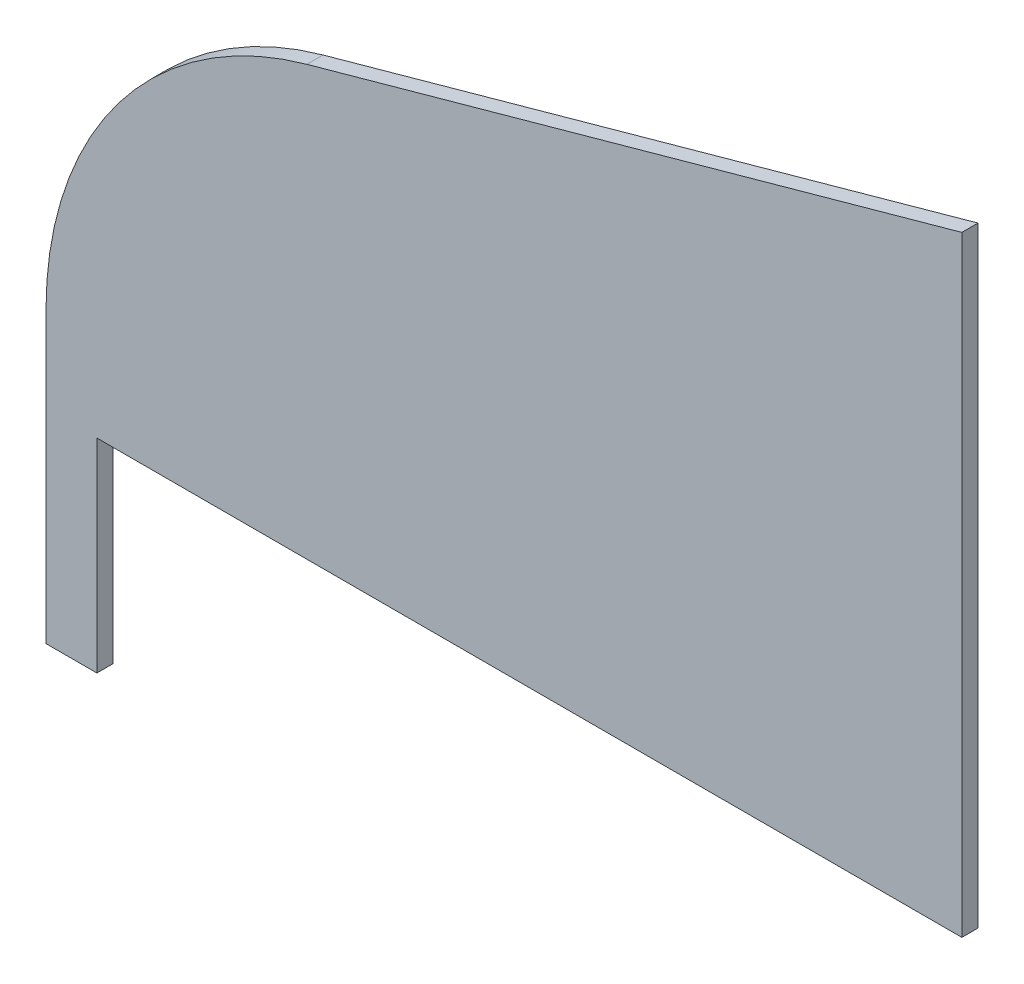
ISO-10303-21;
HEADER;
FILE_DESCRIPTION(('STEP AP214'),'2;1');
FILE_NAME('part.step','',(''),(''),'','','');
FILE_SCHEMA(('AUTOMOTIVE_DESIGN { 1 0 10303 214 1 1 1 1 }'));
ENDSEC;
DATA;
#1=APPLICATION_CONTEXT('core data for automotive mechanical design processes');
#2=APPLICATION_PROTOCOL_DEFINITION('international standard','automotive_design',2000,#1);
#3=PRODUCT_CONTEXT('',#1,'mechanical');
#4=PRODUCT('Part','Part','',(#3));
#5=PRODUCT_RELATED_PRODUCT_CATEGORY('part','',(#4));
#6=PRODUCT_DEFINITION_FORMATION('','',#4);
#7=PRODUCT_DEFINITION_CONTEXT('part definition',#1,'design');
#8=PRODUCT_DEFINITION('design','',#6,#7);
#9=PRODUCT_DEFINITION_SHAPE('','',#8);
#10=(LENGTH_UNIT() NAMED_UNIT(*) SI_UNIT(.MILLI.,.METRE.));
#11=(NAMED_UNIT(*) PLANE_ANGLE_UNIT() SI_UNIT($,.RADIAN.));
#12=(NAMED_UNIT(*) SI_UNIT($,.STERADIAN.) SOLID_ANGLE_UNIT());
#13=UNCERTAINTY_MEASURE_WITH_UNIT(LENGTH_MEASURE(1.E-05),#10,'distance_accuracy_value','');
#14=(GEOMETRIC_REPRESENTATION_CONTEXT(3) GLOBAL_UNCERTAINTY_ASSIGNED_CONTEXT((#13)) GLOBAL_UNIT_ASSIGNED_CONTEXT((#10,
#11,#12)) REPRESENTATION_CONTEXT('',''));
#15=CARTESIAN_POINT('',(0.,0.,0.));
#16=DIRECTION('',(0.,0.,1.));
#17=DIRECTION('',(1.,0.,0.));
#18=AXIS2_PLACEMENT_3D('',#15,#16,#17);
#19=CARTESIAN_POINT('',(0.,0.,3.175));
#20=DIRECTION('',(-1.,0.,0.));
#21=DIRECTION('',(0.,-1.,0.));
#22=AXIS2_PLACEMENT_3D('',#19,#20,#21);
#23=PLANE('',#22);
#24=DIRECTION('',(0.,1.,0.));
#25=VECTOR('',#24,1.);
#26=CARTESIAN_POINT('',(0.,0.,0.));
#27=LINE('',#26,#25);
#28=CARTESIAN_POINT('',(0.,-50.,0.));
#29=VERTEX_POINT('',#28);
#30=CARTESIAN_POINT('',(0.,70.,0.));
#31=VERTEX_POINT('',#30);
#32=EDGE_CURVE('E82',#29,#31,#27,.T.);
#33=ORIENTED_EDGE('',*,*,#32,.T.);
#34=DIRECTION('',(0.,0.,-1.));
#35=VECTOR('',#34,1.);
#36=CARTESIAN_POINT('',(0.,70.,3.175));
#37=LINE('',#36,#35);
#38=CARTESIAN_POINT('',(0.,70.,3.175));
#39=VERTEX_POINT('',#38);
#40=EDGE_CURVE('E11',#39,#31,#37,.T.);
#41=ORIENTED_EDGE('',*,*,#40,.F.);
#42=DIRECTION('',(0.,1.,0.));
#43=VECTOR('',#42,1.);
#44=CARTESIAN_POINT('',(0.,0.,3.175));
#45=LINE('',#44,#43);
#46=CARTESIAN_POINT('',(0.,-50.,3.175));
#47=VERTEX_POINT('',#46);
#48=EDGE_CURVE('E88',#47,#39,#45,.T.);
#49=ORIENTED_EDGE('',*,*,#48,.F.);
#50=DIRECTION('',(0.,0.,-1.));
#51=VECTOR('',#50,1.);
#52=CARTESIAN_POINT('',(0.,-50.,3.175));
#53=LINE('',#52,#51);
#54=EDGE_CURVE('E119',#47,#29,#53,.T.);
#55=ORIENTED_EDGE('',*,*,#54,.T.);
#56=EDGE_LOOP('',(#33,#41,#49,#55));
#57=FACE_BOUND('',#56,.T.);
#58=ADVANCED_FACE('F33',(#57),#23,.F.);
#59=CARTESIAN_POINT('',(0.,70.,3.175));
#60=DIRECTION('',(0.267643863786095,-0.963517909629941,0.));
#61=DIRECTION('',(0.963517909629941,0.267643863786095,0.));
#62=AXIS2_PLACEMENT_3D('',#59,#60,#61);
#63=PLANE('',#62);
#64=DIRECTION('',(-0.963517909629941,-0.267643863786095,0.));
#65=VECTOR('',#64,1.);
#66=CARTESIAN_POINT('',(0.,70.,0.));
#67=LINE('',#66,#65);
#68=CARTESIAN_POINT('',(-128.735070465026,34.2402582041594,0.));
#69=VERTEX_POINT('',#68);
#70=EDGE_CURVE('E124',#31,#69,#67,.T.);
#71=ORIENTED_EDGE('',*,*,#70,.T.);
#72=DIRECTION('',(0.,0.,-1.));
#73=VECTOR('',#72,1.);
#74=CARTESIAN_POINT('',(-128.735070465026,34.2402582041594,3.175));
#75=LINE('',#74,#73);
#76=CARTESIAN_POINT('',(-128.735070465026,34.2402582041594,3.175));
#77=VERTEX_POINT('',#76);
#78=EDGE_CURVE('E41',#77,#69,#75,.T.);
#79=ORIENTED_EDGE('',*,*,#78,.F.);
#80=DIRECTION('',(-0.963517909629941,-0.267643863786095,0.));
#81=VECTOR('',#80,1.);
#82=CARTESIAN_POINT('',(0.,70.,3.175));
#83=LINE('',#82,#81);
#84=EDGE_CURVE('E154',#39,#77,#83,.T.);
#85=ORIENTED_EDGE('',*,*,#84,.F.);
#86=ORIENTED_EDGE('',*,*,#40,.T.);
#87=EDGE_LOOP('',(#71,#79,#85,#86));
#88=FACE_BOUND('',#87,.T.);
#89=ADVANCED_FACE('F158',(#88),#63,.F.);
#90=CARTESIAN_POINT('',(-110.,-33.2059954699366,3.175));
#91=DIRECTION('',(0.,0.,-1.));
#92=DIRECTION('',(-1.,0.,0.));
#93=AXIS2_PLACEMENT_3D('',#90,#91,#92);
#94=CYLINDRICAL_SURFACE('',#93,70.);
#95=CARTESIAN_POINT('',(-110.,-33.2059954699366,0.));
#96=DIRECTION('',(0.,0.,1.));
#97=DIRECTION('',(1.,0.,0.));
#98=AXIS2_PLACEMENT_3D('',#95,#96,#97);
#99=CIRCLE('',#98,70.);
#100=CARTESIAN_POINT('',(-180.,-33.205995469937,0.));
#101=VERTEX_POINT('',#100);
#102=EDGE_CURVE('E126',#69,#101,#99,.T.);
#103=ORIENTED_EDGE('',*,*,#102,.T.);
#104=DIRECTION('',(0.,0.,-1.));
#105=VECTOR('',#104,1.);
#106=CARTESIAN_POINT('',(-180.,-33.205995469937,3.175));
#107=LINE('',#106,#105);
#108=CARTESIAN_POINT('',(-180.,-33.205995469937,3.175));
#109=VERTEX_POINT('',#108);
#110=EDGE_CURVE('E138',#109,#101,#107,.T.);
#111=ORIENTED_EDGE('',*,*,#110,.F.);
#112=CARTESIAN_POINT('',(-110.,-33.2059954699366,3.175));
#113=DIRECTION('',(0.,0.,1.));
#114=DIRECTION('',(1.,0.,0.));
#115=AXIS2_PLACEMENT_3D('',#112,#113,#114);
#116=CIRCLE('',#115,70.);
#117=EDGE_CURVE('E147',#77,#109,#116,.T.);
#118=ORIENTED_EDGE('',*,*,#117,.F.);
#119=ORIENTED_EDGE('',*,*,#78,.T.);
#120=EDGE_LOOP('',(#103,#111,#118,#119));
#121=FACE_BOUND('',#120,.T.);
#122=ADVANCED_FACE('F145',(#121),#94,.T.);
#123=CARTESIAN_POINT('',(-180.,-33.205995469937,3.175));
#124=DIRECTION('',(1.,0.,0.));
#125=DIRECTION('',(0.,0.,-1.));
#126=AXIS2_PLACEMENT_3D('',#123,#124,#125);
#127=PLANE('',#126);
#128=DIRECTION('',(0.,-1.,0.));
#129=VECTOR('',#128,1.);
#130=CARTESIAN_POINT('',(-180.,-33.205995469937,0.));
#131=LINE('',#130,#129);
#132=CARTESIAN_POINT('',(-180.,-90.,0.));
#133=VERTEX_POINT('',#132);
#134=EDGE_CURVE('E128',#101,#133,#131,.T.);
#135=ORIENTED_EDGE('',*,*,#134,.T.);
#136=DIRECTION('',(0.,0.,-1.));
#137=VECTOR('',#136,1.);
#138=CARTESIAN_POINT('',(-180.,-90.,3.175));
#139=LINE('',#138,#137);
#140=CARTESIAN_POINT('',(-180.,-90.,3.175));
#141=VERTEX_POINT('',#140);
#142=EDGE_CURVE('E114',#141,#133,#139,.T.);
#143=ORIENTED_EDGE('',*,*,#142,.F.);
#144=DIRECTION('',(0.,-1.,0.));
#145=VECTOR('',#144,1.);
#146=CARTESIAN_POINT('',(-180.,-33.205995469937,3.175));
#147=LINE('',#146,#145);
#148=EDGE_CURVE('E105',#109,#141,#147,.T.);
#149=ORIENTED_EDGE('',*,*,#148,.F.);
#150=ORIENTED_EDGE('',*,*,#110,.T.);
#151=EDGE_LOOP('',(#135,#143,#149,#150));
#152=FACE_BOUND('',#151,.T.);
#153=ADVANCED_FACE('F153',(#152),#127,.F.);
#154=CARTESIAN_POINT('',(-170.,-90.,3.175));
#155=DIRECTION('',(0.,1.,0.));
#156=DIRECTION('',(0.,0.,1.));
#157=AXIS2_PLACEMENT_3D('',#154,#155,#156);
#158=PLANE('',#157);
#159=DIRECTION('',(1.,0.,0.));
#160=VECTOR('',#159,1.);
#161=CARTESIAN_POINT('',(-170.,-90.,0.));
#162=LINE('',#161,#160);
#163=CARTESIAN_POINT('',(-170.,-90.,0.));
#164=VERTEX_POINT('',#163);
#165=EDGE_CURVE('E113',#133,#164,#162,.T.);
#166=ORIENTED_EDGE('',*,*,#165,.T.);
#167=DIRECTION('',(0.,0.,-1.));
#168=VECTOR('',#167,1.);
#169=CARTESIAN_POINT('',(-170.,-90.,3.175));
#170=LINE('',#169,#168);
#171=CARTESIAN_POINT('',(-170.,-90.,3.175));
#172=VERTEX_POINT('',#171);
#173=EDGE_CURVE('E110',#172,#164,#170,.T.);
#174=ORIENTED_EDGE('',*,*,#173,.F.);
#175=DIRECTION('',(1.,0.,0.));
#176=VECTOR('',#175,1.);
#177=CARTESIAN_POINT('',(-170.,-90.,3.175));
#178=LINE('',#177,#176);
#179=EDGE_CURVE('E99',#141,#172,#178,.T.);
#180=ORIENTED_EDGE('',*,*,#179,.F.);
#181=ORIENTED_EDGE('',*,*,#142,.T.);
#182=EDGE_LOOP('',(#166,#174,#180,#181));
#183=FACE_BOUND('',#182,.T.);
#184=ADVANCED_FACE('F111',(#183),#158,.F.);
#185=CARTESIAN_POINT('',(-170.,-90.,3.175));
#186=DIRECTION('',(-1.,0.,0.));
#187=DIRECTION('',(0.,-1.,0.));
#188=AXIS2_PLACEMENT_3D('',#185,#186,#187);
#189=PLANE('',#188);
#190=DIRECTION('',(0.,1.,0.));
#191=VECTOR('',#190,1.);
#192=CARTESIAN_POINT('',(-170.,-90.,0.));
#193=LINE('',#192,#191);
#194=CARTESIAN_POINT('',(-170.,-50.,0.));
#195=VERTEX_POINT('',#194);
#196=EDGE_CURVE('E75',#164,#195,#193,.T.);
#197=ORIENTED_EDGE('',*,*,#196,.T.);
#198=DIRECTION('',(0.,0.,-1.));
#199=VECTOR('',#198,1.);
#200=CARTESIAN_POINT('',(-170.,-50.,3.175));
#201=LINE('',#200,#199);
#202=CARTESIAN_POINT('',(-170.,-50.,3.175));
#203=VERTEX_POINT('',#202);
#204=EDGE_CURVE('E115',#203,#195,#201,.T.);
#205=ORIENTED_EDGE('',*,*,#204,.F.);
#206=DIRECTION('',(0.,1.,0.));
#207=VECTOR('',#206,1.);
#208=CARTESIAN_POINT('',(-170.,-90.,3.175));
#209=LINE('',#208,#207);
#210=EDGE_CURVE('E103',#172,#203,#209,.T.);
#211=ORIENTED_EDGE('',*,*,#210,.F.);
#212=ORIENTED_EDGE('',*,*,#173,.T.);
#213=EDGE_LOOP('',(#197,#205,#211,#212));
#214=FACE_BOUND('',#213,.T.);
#215=ADVANCED_FACE('F117',(#214),#189,.F.);
#216=CARTESIAN_POINT('',(-170.,-50.,3.175));
#217=DIRECTION('',(0.,1.,0.));
#218=DIRECTION('',(0.,0.,1.));
#219=AXIS2_PLACEMENT_3D('',#216,#217,#218);
#220=PLANE('',#219);
#221=DIRECTION('',(1.,0.,0.));
#222=VECTOR('',#221,1.);
#223=CARTESIAN_POINT('',(-170.,-50.,0.));
#224=LINE('',#223,#222);
#225=EDGE_CURVE('E132',#195,#29,#224,.T.);
#226=ORIENTED_EDGE('',*,*,#225,.T.);
#227=ORIENTED_EDGE('',*,*,#54,.F.);
#228=DIRECTION('',(1.,0.,0.));
#229=VECTOR('',#228,1.);
#230=CARTESIAN_POINT('',(-170.,-50.,3.175));
#231=LINE('',#230,#229);
#232=EDGE_CURVE('E49',#203,#47,#231,.T.);
#233=ORIENTED_EDGE('',*,*,#232,.F.);
#234=ORIENTED_EDGE('',*,*,#204,.T.);
#235=EDGE_LOOP('',(#226,#227,#233,#234));
#236=FACE_BOUND('',#235,.T.);
#237=ADVANCED_FACE('F161',(#236),#220,.F.);
#238=CARTESIAN_POINT('',(-110.,-33.2059954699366,3.175));
#239=DIRECTION('',(0.,0.,1.));
#240=DIRECTION('',(1.,0.,0.));
#241=AXIS2_PLACEMENT_3D('',#238,#239,#240);
#242=PLANE('',#241);
#243=ORIENTED_EDGE('',*,*,#48,.T.);
#244=ORIENTED_EDGE('',*,*,#84,.T.);
#245=ORIENTED_EDGE('',*,*,#117,.T.);
#246=ORIENTED_EDGE('',*,*,#148,.T.);
#247=ORIENTED_EDGE('',*,*,#179,.T.);
#248=ORIENTED_EDGE('',*,*,#210,.T.);
#249=ORIENTED_EDGE('',*,*,#232,.T.);
#250=EDGE_LOOP('',(#243,#244,#245,#246,#247,#248,#249));
#251=FACE_BOUND('',#250,.T.);
#252=ADVANCED_FACE('F101',(#251),#242,.T.);
#253=CARTESIAN_POINT('',(-110.,-33.2059954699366,0.));
#254=DIRECTION('',(0.,0.,1.));
#255=DIRECTION('',(1.,0.,0.));
#256=AXIS2_PLACEMENT_3D('',#253,#254,#255);
#257=PLANE('',#256);
#258=ORIENTED_EDGE('',*,*,#32,.F.);
#259=ORIENTED_EDGE('',*,*,#225,.F.);
#260=ORIENTED_EDGE('',*,*,#196,.F.);
#261=ORIENTED_EDGE('',*,*,#165,.F.);
#262=ORIENTED_EDGE('',*,*,#134,.F.);
#263=ORIENTED_EDGE('',*,*,#102,.F.);
#264=ORIENTED_EDGE('',*,*,#70,.F.);
#265=EDGE_LOOP('',(#258,#259,#260,#261,#262,#263,#264));
#266=FACE_BOUND('',#265,.T.);
#267=ADVANCED_FACE('F151',(#266),#257,.F.);
#268=CLOSED_SHELL('',(#58,#89,#122,#153,#184,#215,#237,#252,#267));
#269=MANIFOLD_SOLID_BREP('B2',#268);
#270=ADVANCED_BREP_SHAPE_REPRESENTATION('',(#18,#269),#14);
#271=SHAPE_DEFINITION_REPRESENTATION(#9,#270);
ENDSEC;
END-ISO-10303-21;
